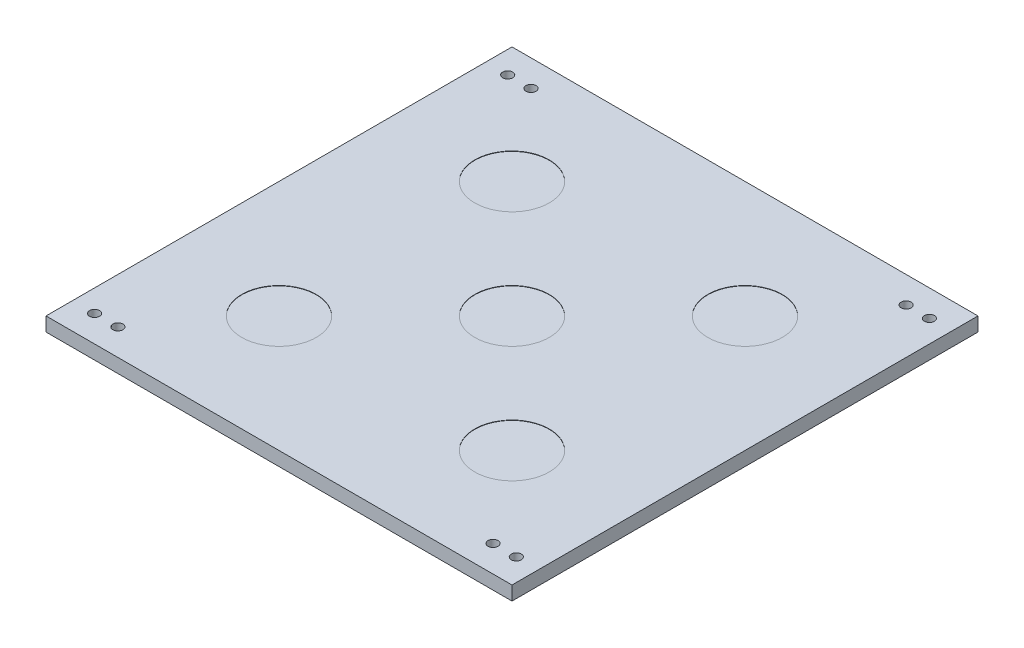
from build123d import *

# Parameters (mm, degrees)
SKETCH1_W           = 200
SKETCH1_H           = 200
SKETCH1_R           = 2.15
BOSS_EXTRUDE1_DEPTH = 6
SKETCH2_R           = 16
CUT_EXTRUDE1_DEPTH  = 0.15


with BuildPart() as part:
    # Sketch1 → Boss-Extrude1 (new body)
    with BuildSketch(Plane(origin=(0, 0, 0), x_dir=(1, 0, 0), z_dir=(0, 1, 0))):
        Rectangle(SKETCH1_W, SKETCH1_H)
        with Locations(Location((-80.5, 88.65, 0), (0, 0, 270))):
            Circle(SKETCH1_R, mode=Mode.SUBTRACT)
        with Locations(Location((-90.5, 88.65, 0), (0, 0, 270))):
            Circle(SKETCH1_R, mode=Mode.SUBTRACT)
        with Locations(Location((80.5, 88.65, 0), (0, 0, 90))):
            Circle(SKETCH1_R, mode=Mode.SUBTRACT)
        with Locations(Location((90.5, 88.65, 0), (0, 0, 90))):
            Circle(SKETCH1_R, mode=Mode.SUBTRACT)
        with Locations(Location((90.5, -88.65, 0), (0, 0, 270))):
            Circle(SKETCH1_R, mode=Mode.SUBTRACT)
        with Locations(Location((80.5, -88.65, 0), (0, 0, 270))):
            Circle(SKETCH1_R, mode=Mode.SUBTRACT)
        with Locations(Location((-80.5, -88.65, 0), (0, 0, 90))):
            Circle(SKETCH1_R, mode=Mode.SUBTRACT)
        with Locations(Location((-90.5, -88.65, 0), (0, 0, 90))):
            Circle(SKETCH1_R, mode=Mode.SUBTRACT)
    extrude(amount=BOSS_EXTRUDE1_DEPTH)

    # Sketch2 → Cut-Extrude1 (cut)
    with BuildSketch(Plane(origin=(0, 6, 0), x_dir=(1, 0, 0), z_dir=(0, 1, 0))):
        with Locations(Location((0, 0, 0), (0, 0, 270))):
            Circle(SKETCH2_R)
        with Locations(Location((-50, 50, 0), (0, 0, 270))):
            Circle(SKETCH2_R)
        with Locations(Location((50, 50, 0), (0, 0, 270))):
            Circle(SKETCH2_R)
        with Locations(Location((50, -50, 0), (0, 0, 270))):
            Circle(SKETCH2_R)
        with Locations(Location((-50, -50, 0), (0, 0, 270))):
            Circle(SKETCH2_R)
    extrude(amount=-CUT_EXTRUDE1_DEPTH, mode=Mode.SUBTRACT)


solid = part.part
